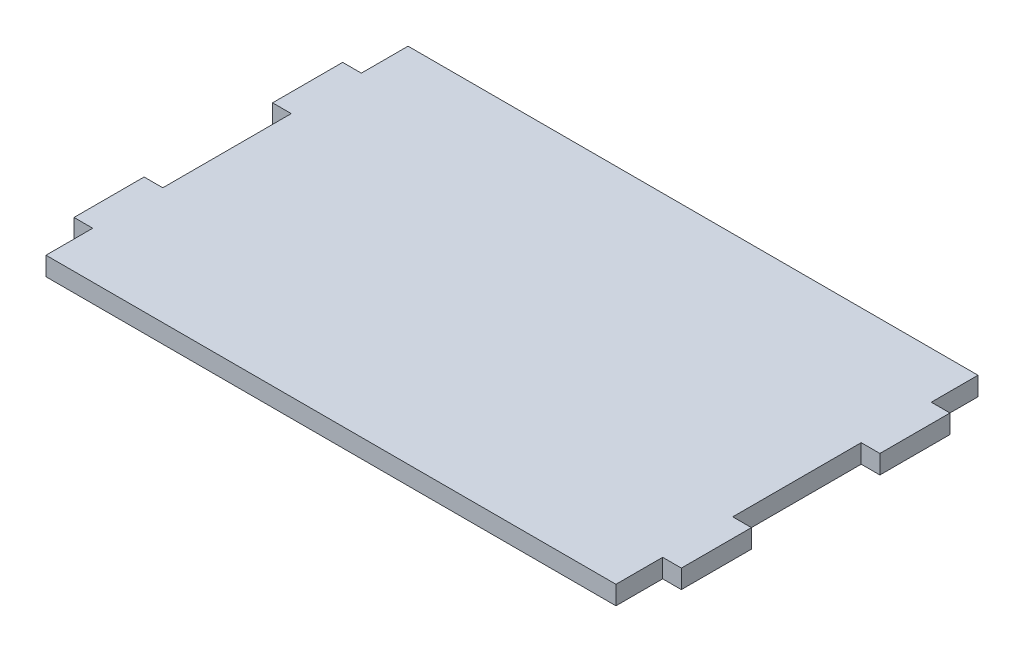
from build123d import *

# Parameters (mm, degrees)
AUFSATZ_LINEAR_AUSTRAGEN1_DEPTH = 4


with BuildPart() as part:
    # Skizze2 → Aufsatz-Linear austragen1 (new body)
    with BuildSketch(Plane(origin=(0, 0, 0), x_dir=(1, 0, 0), z_dir=(0, 1, 0))):
        Polygon((-61, 38.75), (61, 38.75), (61, 28.75), (65, 28.75), (65, 13.75), (61, 13.75), (61, -13.75), (65, -13.75), (65, -28.75), (61, -28.75), (61, -38.75), (-61, -38.75), (-61, -28.75), (-65, -28.75), (-65, -13.75), (-61, -13.75), (-61, 13.75), (-65, 13.75), (-65, 28.75), (-61, 28.75), align=None)
    extrude(amount=AUFSATZ_LINEAR_AUSTRAGEN1_DEPTH)


solid = part.part
